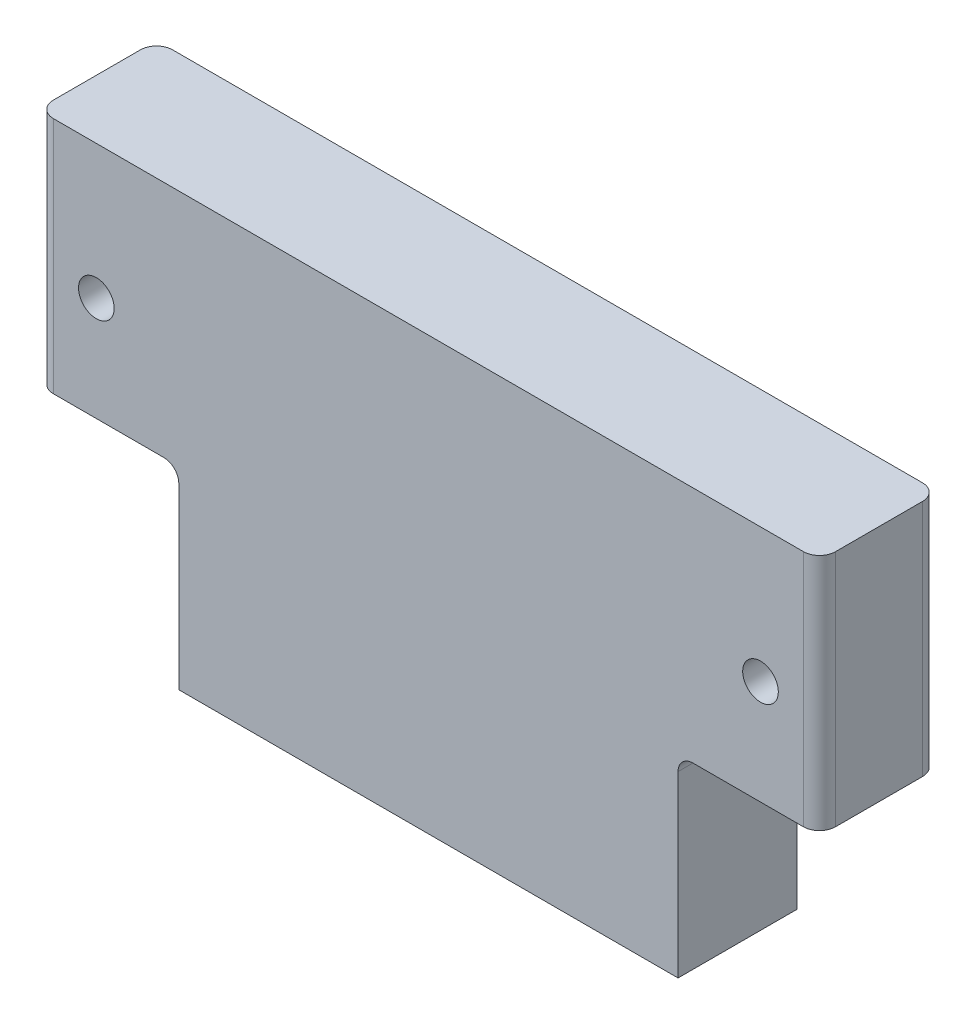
ISO-10303-21;
HEADER;
FILE_DESCRIPTION(('STEP AP214'),'2;1');
FILE_NAME('part.step','',(''),(''),'','','');
FILE_SCHEMA(('AUTOMOTIVE_DESIGN { 1 0 10303 214 1 1 1 1 }'));
ENDSEC;
DATA;
#1=APPLICATION_CONTEXT('core data for automotive mechanical design processes');
#2=APPLICATION_PROTOCOL_DEFINITION('international standard','automotive_design',2000,#1);
#3=PRODUCT_CONTEXT('',#1,'mechanical');
#4=PRODUCT('Part','Part','',(#3));
#5=PRODUCT_RELATED_PRODUCT_CATEGORY('part','',(#4));
#6=PRODUCT_DEFINITION_FORMATION('','',#4);
#7=PRODUCT_DEFINITION_CONTEXT('part definition',#1,'design');
#8=PRODUCT_DEFINITION('design','',#6,#7);
#9=PRODUCT_DEFINITION_SHAPE('','',#8);
#10=(LENGTH_UNIT() NAMED_UNIT(*) SI_UNIT(.MILLI.,.METRE.));
#11=(NAMED_UNIT(*) PLANE_ANGLE_UNIT() SI_UNIT($,.RADIAN.));
#12=(NAMED_UNIT(*) SI_UNIT($,.STERADIAN.) SOLID_ANGLE_UNIT());
#13=UNCERTAINTY_MEASURE_WITH_UNIT(LENGTH_MEASURE(1.E-05),#10,'distance_accuracy_value','');
#14=(GEOMETRIC_REPRESENTATION_CONTEXT(3) GLOBAL_UNCERTAINTY_ASSIGNED_CONTEXT((#13)) GLOBAL_UNIT_ASSIGNED_CONTEXT((#10,
#11,#12)) REPRESENTATION_CONTEXT('',''));
#15=CARTESIAN_POINT('',(0.,0.,0.));
#16=DIRECTION('',(0.,0.,1.));
#17=DIRECTION('',(1.,0.,0.));
#18=AXIS2_PLACEMENT_3D('',#15,#16,#17);
#19=CARTESIAN_POINT('',(-41.6814,-12.7,6.35));
#20=DIRECTION('',(0.,1.,0.));
#21=DIRECTION('',(0.,0.,1.));
#22=AXIS2_PLACEMENT_3D('',#19,#20,#21);
#23=PLANE('',#22);
#24=DIRECTION('',(1.,0.,0.));
#25=VECTOR('',#24,1.);
#26=CARTESIAN_POINT('',(-41.6814,-12.7,6.35));
#27=LINE('',#26,#25);
#28=CARTESIAN_POINT('',(28.1940000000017,-12.7,6.35));
#29=VERTEX_POINT('',#28);
#30=CARTESIAN_POINT('',(39.9669,-12.7,6.35));
#31=VERTEX_POINT('',#30);
#32=EDGE_CURVE('E183',#29,#31,#27,.T.);
#33=ORIENTED_EDGE('',*,*,#32,.F.);
#34=DIRECTION('',(0.,0.,1.));
#35=VECTOR('',#34,1.);
#36=CARTESIAN_POINT('',(28.1940000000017,-12.7,6.35));
#37=LINE('',#36,#35);
#38=CARTESIAN_POINT('',(28.1940000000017,-12.7,-6.35));
#39=VERTEX_POINT('',#38);
#40=EDGE_CURVE('E58',#29,#39,#37,.F.);
#41=ORIENTED_EDGE('',*,*,#40,.T.);
#42=DIRECTION('',(1.,0.,0.));
#43=VECTOR('',#42,1.);
#44=CARTESIAN_POINT('',(-41.6814,-12.7,-6.35));
#45=LINE('',#44,#43);
#46=CARTESIAN_POINT('',(39.9669,-12.7,-6.35));
#47=VERTEX_POINT('',#46);
#48=EDGE_CURVE('E190',#39,#47,#45,.T.);
#49=ORIENTED_EDGE('',*,*,#48,.T.);
#50=CARTESIAN_POINT('',(39.9669,-12.7,-4.6355));
#51=DIRECTION('',(0.,1.,0.));
#52=DIRECTION('',(0.,0.,1.));
#53=AXIS2_PLACEMENT_3D('',#50,#51,#52);
#54=CIRCLE('',#53,1.7145);
#55=CARTESIAN_POINT('',(41.6814,-12.7,-4.6355));
#56=VERTEX_POINT('',#55);
#57=EDGE_CURVE('E240',#47,#56,#54,.F.);
#58=ORIENTED_EDGE('',*,*,#57,.T.);
#59=DIRECTION('',(0.,0.,-1.));
#60=VECTOR('',#59,1.);
#61=CARTESIAN_POINT('',(41.6814,-12.7,6.35));
#62=LINE('',#61,#60);
#63=CARTESIAN_POINT('',(41.6814,-12.7,4.6355));
#64=VERTEX_POINT('',#63);
#65=EDGE_CURVE('E187',#64,#56,#62,.T.);
#66=ORIENTED_EDGE('',*,*,#65,.F.);
#67=CARTESIAN_POINT('',(39.9669,-12.7,4.6355));
#68=DIRECTION('',(0.,1.,0.));
#69=DIRECTION('',(0.,0.,1.));
#70=AXIS2_PLACEMENT_3D('',#67,#68,#69);
#71=CIRCLE('',#70,1.7145);
#72=EDGE_CURVE('E237',#64,#31,#71,.F.);
#73=ORIENTED_EDGE('',*,*,#72,.T.);
#74=EDGE_LOOP('',(#33,#41,#49,#58,#66,#73));
#75=FACE_BOUND('',#74,.T.);
#76=ADVANCED_FACE('F37',(#75),#23,.F.);
#77=CARTESIAN_POINT('',(41.6814,12.7,6.35));
#78=DIRECTION('',(-1.,0.,0.));
#79=DIRECTION('',(0.,0.,1.));
#80=AXIS2_PLACEMENT_3D('',#77,#78,#79);
#81=PLANE('',#80);
#82=ORIENTED_EDGE('',*,*,#65,.T.);
#83=DIRECTION('',(0.,1.,0.));
#84=VECTOR('',#83,1.);
#85=CARTESIAN_POINT('',(41.6814,12.7,-4.6355));
#86=LINE('',#85,#84);
#87=CARTESIAN_POINT('',(41.6814,12.7,-4.6355));
#88=VERTEX_POINT('',#87);
#89=EDGE_CURVE('E234',#56,#88,#86,.T.);
#90=ORIENTED_EDGE('',*,*,#89,.T.);
#91=DIRECTION('',(0.,0.,-1.));
#92=VECTOR('',#91,1.);
#93=CARTESIAN_POINT('',(41.6814,12.7,6.35));
#94=LINE('',#93,#92);
#95=CARTESIAN_POINT('',(41.6814,12.7,4.6355));
#96=VERTEX_POINT('',#95);
#97=EDGE_CURVE('E201',#96,#88,#94,.T.);
#98=ORIENTED_EDGE('',*,*,#97,.F.);
#99=DIRECTION('',(0.,1.,0.));
#100=VECTOR('',#99,1.);
#101=CARTESIAN_POINT('',(41.6814,-12.7,4.6355));
#102=LINE('',#101,#100);
#103=EDGE_CURVE('E232',#96,#64,#102,.F.);
#104=ORIENTED_EDGE('',*,*,#103,.T.);
#105=EDGE_LOOP('',(#82,#90,#98,#104));
#106=FACE_BOUND('',#105,.T.);
#107=ADVANCED_FACE('F275',(#106),#81,.F.);
#108=CARTESIAN_POINT('',(-41.6814,12.7,6.35));
#109=DIRECTION('',(0.,-1.,0.));
#110=DIRECTION('',(0.,0.,-1.));
#111=AXIS2_PLACEMENT_3D('',#108,#109,#110);
#112=PLANE('',#111);
#113=DIRECTION('',(-1.,0.,0.));
#114=VECTOR('',#113,1.);
#115=CARTESIAN_POINT('',(-41.6814,12.7,-6.35));
#116=LINE('',#115,#114);
#117=CARTESIAN_POINT('',(39.9669,12.7,-6.35));
#118=VERTEX_POINT('',#117);
#119=CARTESIAN_POINT('',(-39.9669,12.7,-6.35));
#120=VERTEX_POINT('',#119);
#121=EDGE_CURVE('E180',#118,#120,#116,.T.);
#122=ORIENTED_EDGE('',*,*,#121,.T.);
#123=CARTESIAN_POINT('',(-39.9669,12.7,-4.6355));
#124=DIRECTION('',(0.,-1.,0.));
#125=DIRECTION('',(0.,0.,-1.));
#126=AXIS2_PLACEMENT_3D('',#123,#124,#125);
#127=CIRCLE('',#126,1.7145);
#128=CARTESIAN_POINT('',(-41.6814,12.7,-4.6355));
#129=VERTEX_POINT('',#128);
#130=EDGE_CURVE('E224',#120,#129,#127,.F.);
#131=ORIENTED_EDGE('',*,*,#130,.T.);
#132=DIRECTION('',(0.,0.,-1.));
#133=VECTOR('',#132,1.);
#134=CARTESIAN_POINT('',(-41.6814,12.7,6.35));
#135=LINE('',#134,#133);
#136=CARTESIAN_POINT('',(-41.6814,12.7,4.6355));
#137=VERTEX_POINT('',#136);
#138=EDGE_CURVE('E198',#137,#129,#135,.T.);
#139=ORIENTED_EDGE('',*,*,#138,.F.);
#140=CARTESIAN_POINT('',(-39.9669,12.7,4.6355));
#141=DIRECTION('',(0.,-1.,0.));
#142=DIRECTION('',(0.,0.,-1.));
#143=AXIS2_PLACEMENT_3D('',#140,#141,#142);
#144=CIRCLE('',#143,1.7145);
#145=CARTESIAN_POINT('',(-39.9669,12.7,6.35));
#146=VERTEX_POINT('',#145);
#147=EDGE_CURVE('E222',#137,#146,#144,.F.);
#148=ORIENTED_EDGE('',*,*,#147,.T.);
#149=DIRECTION('',(-1.,0.,0.));
#150=VECTOR('',#149,1.);
#151=CARTESIAN_POINT('',(-41.6814,12.7,6.35));
#152=LINE('',#151,#150);
#153=CARTESIAN_POINT('',(39.9669,12.7,6.35));
#154=VERTEX_POINT('',#153);
#155=EDGE_CURVE('E181',#154,#146,#152,.T.);
#156=ORIENTED_EDGE('',*,*,#155,.F.);
#157=CARTESIAN_POINT('',(39.9669,12.7,4.6355));
#158=DIRECTION('',(0.,-1.,0.));
#159=DIRECTION('',(0.,0.,-1.));
#160=AXIS2_PLACEMENT_3D('',#157,#158,#159);
#161=CIRCLE('',#160,1.7145);
#162=EDGE_CURVE('E218',#154,#96,#161,.F.);
#163=ORIENTED_EDGE('',*,*,#162,.T.);
#164=ORIENTED_EDGE('',*,*,#97,.T.);
#165=CARTESIAN_POINT('',(39.9669,12.7,-4.6355));
#166=DIRECTION('',(0.,-1.,0.));
#167=DIRECTION('',(0.,0.,-1.));
#168=AXIS2_PLACEMENT_3D('',#165,#166,#167);
#169=CIRCLE('',#168,1.7145);
#170=EDGE_CURVE('E220',#88,#118,#169,.F.);
#171=ORIENTED_EDGE('',*,*,#170,.T.);
#172=EDGE_LOOP('',(#122,#131,#139,#148,#156,#163,#164,#171));
#173=FACE_BOUND('',#172,.T.);
#174=ADVANCED_FACE('F280',(#173),#112,.F.);
#175=CARTESIAN_POINT('',(-41.6814,12.7,6.35));
#176=DIRECTION('',(1.,0.,0.));
#177=DIRECTION('',(0.,0.,-1.));
#178=AXIS2_PLACEMENT_3D('',#175,#176,#177);
#179=PLANE('',#178);
#180=ORIENTED_EDGE('',*,*,#138,.T.);
#181=DIRECTION('',(0.,-1.,0.));
#182=VECTOR('',#181,1.);
#183=CARTESIAN_POINT('',(-41.6814,12.7,-4.6355));
#184=LINE('',#183,#182);
#185=CARTESIAN_POINT('',(-41.6814,-12.7,-4.6355));
#186=VERTEX_POINT('',#185);
#187=EDGE_CURVE('E206',#129,#186,#184,.T.);
#188=ORIENTED_EDGE('',*,*,#187,.T.);
#189=DIRECTION('',(0.,0.,-1.));
#190=VECTOR('',#189,1.);
#191=CARTESIAN_POINT('',(-41.6814,-12.7,6.35));
#192=LINE('',#191,#190);
#193=CARTESIAN_POINT('',(-41.6814,-12.7,4.6355));
#194=VERTEX_POINT('',#193);
#195=EDGE_CURVE('E195',#194,#186,#192,.T.);
#196=ORIENTED_EDGE('',*,*,#195,.F.);
#197=DIRECTION('',(0.,-1.,0.));
#198=VECTOR('',#197,1.);
#199=CARTESIAN_POINT('',(-41.6814,12.7,4.6355));
#200=LINE('',#199,#198);
#201=EDGE_CURVE('E204',#194,#137,#200,.F.);
#202=ORIENTED_EDGE('',*,*,#201,.T.);
#203=EDGE_LOOP('',(#180,#188,#196,#202));
#204=FACE_BOUND('',#203,.T.);
#205=ADVANCED_FACE('F286',(#204),#179,.F.);
#206=CARTESIAN_POINT('',(-39.9669,-12.7,-6.35));
#207=VERTEX_POINT('',#206);
#208=CARTESIAN_POINT('',(-28.1940000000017,-12.7,-6.35));
#209=VERTEX_POINT('',#208);
#210=EDGE_CURVE('E184',#207,#209,#45,.T.);
#211=ORIENTED_EDGE('',*,*,#210,.T.);
#212=DIRECTION('',(0.,0.,1.));
#213=VECTOR('',#212,1.);
#214=CARTESIAN_POINT('',(-28.1940000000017,-12.7,6.35));
#215=LINE('',#214,#213);
#216=CARTESIAN_POINT('',(-28.1940000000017,-12.7,6.35));
#217=VERTEX_POINT('',#216);
#218=EDGE_CURVE('E242',#209,#217,#215,.T.);
#219=ORIENTED_EDGE('',*,*,#218,.T.);
#220=CARTESIAN_POINT('',(-39.9669,-12.7,6.35));
#221=VERTEX_POINT('',#220);
#222=EDGE_CURVE('E185',#221,#217,#27,.T.);
#223=ORIENTED_EDGE('',*,*,#222,.F.);
#224=CARTESIAN_POINT('',(-39.9669,-12.7,4.6355));
#225=DIRECTION('',(0.,1.,0.));
#226=DIRECTION('',(0.,0.,1.));
#227=AXIS2_PLACEMENT_3D('',#224,#225,#226);
#228=CIRCLE('',#227,1.7145);
#229=EDGE_CURVE('E209',#221,#194,#228,.F.);
#230=ORIENTED_EDGE('',*,*,#229,.T.);
#231=ORIENTED_EDGE('',*,*,#195,.T.);
#232=CARTESIAN_POINT('',(-39.9669,-12.7,-4.6355));
#233=DIRECTION('',(0.,1.,0.));
#234=DIRECTION('',(0.,0.,1.));
#235=AXIS2_PLACEMENT_3D('',#232,#233,#234);
#236=CIRCLE('',#235,1.7145);
#237=EDGE_CURVE('E211',#186,#207,#236,.F.);
#238=ORIENTED_EDGE('',*,*,#237,.T.);
#239=EDGE_LOOP('',(#211,#219,#223,#230,#231,#238));
#240=FACE_BOUND('',#239,.T.);
#241=ADVANCED_FACE('F261',(#240),#23,.F.);
#242=CARTESIAN_POINT('',(0.,0.,6.35));
#243=DIRECTION('',(0.,0.,1.));
#244=DIRECTION('',(1.,0.,0.));
#245=AXIS2_PLACEMENT_3D('',#242,#243,#244);
#246=PLANE('',#245);
#247=CARTESIAN_POINT('',(-35.3949,-1.58750000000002,6.35));
#248=DIRECTION('',(0.,0.,1.));
#249=DIRECTION('',(1.,0.,0.));
#250=AXIS2_PLACEMENT_3D('',#247,#248,#249);
#251=CIRCLE('',#250,1.89864999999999);
#252=CARTESIAN_POINT('',(-33.49625,-1.58750000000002,6.35));
#253=VERTEX_POINT('',#252);
#254=EDGE_CURVE('E168',#253,#253,#251,.T.);
#255=ORIENTED_EDGE('',*,*,#254,.F.);
#256=EDGE_LOOP('',(#255));
#257=FACE_BOUND('',#256,.T.);
#258=CARTESIAN_POINT('',(35.3949,-1.5874999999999,6.35));
#259=DIRECTION('',(0.,0.,1.));
#260=DIRECTION('',(1.,0.,0.));
#261=AXIS2_PLACEMENT_3D('',#258,#259,#260);
#262=CIRCLE('',#261,1.89864999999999);
#263=CARTESIAN_POINT('',(37.29355,-1.5874999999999,6.35));
#264=VERTEX_POINT('',#263);
#265=EDGE_CURVE('E174',#264,#264,#262,.T.);
#266=ORIENTED_EDGE('',*,*,#265,.F.);
#267=EDGE_LOOP('',(#266));
#268=FACE_BOUND('',#267,.T.);
#269=ORIENTED_EDGE('',*,*,#155,.T.);
#270=DIRECTION('',(0.,-1.,0.));
#271=VECTOR('',#270,1.);
#272=CARTESIAN_POINT('',(-39.9669,-12.7,6.35));
#273=LINE('',#272,#271);
#274=EDGE_CURVE('E229',#146,#221,#273,.T.);
#275=ORIENTED_EDGE('',*,*,#274,.T.);
#276=ORIENTED_EDGE('',*,*,#222,.T.);
#277=CARTESIAN_POINT('',(-28.1940000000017,-14.2875,6.35));
#278=DIRECTION('',(0.,0.,1.));
#279=DIRECTION('',(1.,0.,0.));
#280=AXIS2_PLACEMENT_3D('',#277,#278,#279);
#281=CIRCLE('',#280,1.5875);
#282=CARTESIAN_POINT('',(-26.6065000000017,-14.2875,6.35));
#283=VERTEX_POINT('',#282);
#284=EDGE_CURVE('E142',#217,#283,#281,.F.);
#285=ORIENTED_EDGE('',*,*,#284,.T.);
#286=DIRECTION('',(0.,-1.,0.));
#287=VECTOR('',#286,1.);
#288=CARTESIAN_POINT('',(-26.6065000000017,-12.7,6.35));
#289=LINE('',#288,#287);
#290=CARTESIAN_POINT('',(-26.6065000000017,-33.3375,6.35));
#291=VERTEX_POINT('',#290);
#292=EDGE_CURVE('E135',#283,#291,#289,.T.);
#293=ORIENTED_EDGE('',*,*,#292,.T.);
#294=DIRECTION('',(1.,0.,0.));
#295=VECTOR('',#294,1.);
#296=CARTESIAN_POINT('',(-26.6065000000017,-33.3375,6.35));
#297=LINE('',#296,#295);
#298=CARTESIAN_POINT('',(26.6065000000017,-33.3375,6.35));
#299=VERTEX_POINT('',#298);
#300=EDGE_CURVE('E140',#291,#299,#297,.T.);
#301=ORIENTED_EDGE('',*,*,#300,.T.);
#302=DIRECTION('',(0.,1.,0.));
#303=VECTOR('',#302,1.);
#304=CARTESIAN_POINT('',(26.6065000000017,-12.7,6.35));
#305=LINE('',#304,#303);
#306=CARTESIAN_POINT('',(26.6065000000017,-14.2875,6.35));
#307=VERTEX_POINT('',#306);
#308=EDGE_CURVE('E155',#299,#307,#305,.T.);
#309=ORIENTED_EDGE('',*,*,#308,.T.);
#310=CARTESIAN_POINT('',(28.1940000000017,-14.2875,6.34999999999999));
#311=DIRECTION('',(0.,0.,1.));
#312=DIRECTION('',(1.,0.,0.));
#313=AXIS2_PLACEMENT_3D('',#310,#311,#312);
#314=CIRCLE('',#313,1.5875);
#315=EDGE_CURVE('E45',#307,#29,#314,.F.);
#316=ORIENTED_EDGE('',*,*,#315,.T.);
#317=ORIENTED_EDGE('',*,*,#32,.T.);
#318=DIRECTION('',(0.,1.,0.));
#319=VECTOR('',#318,1.);
#320=CARTESIAN_POINT('',(39.9669,12.7,6.35));
#321=LINE('',#320,#319);
#322=EDGE_CURVE('E226',#31,#154,#321,.T.);
#323=ORIENTED_EDGE('',*,*,#322,.T.);
#324=EDGE_LOOP('',(#269,#275,#276,#285,#293,#301,#309,#316,#317,#323));
#325=FACE_BOUND('',#324,.T.);
#326=ADVANCED_FACE('F138',(#257,#268,#325),#246,.T.);
#327=CARTESIAN_POINT('',(0.,0.,-6.35));
#328=DIRECTION('',(0.,0.,1.));
#329=DIRECTION('',(1.,0.,0.));
#330=AXIS2_PLACEMENT_3D('',#327,#328,#329);
#331=PLANE('',#330);
#332=CARTESIAN_POINT('',(-35.3949,-1.58750000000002,-6.35));
#333=DIRECTION('',(0.,0.,1.));
#334=DIRECTION('',(1.,0.,0.));
#335=AXIS2_PLACEMENT_3D('',#332,#333,#334);
#336=CIRCLE('',#335,1.89864999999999);
#337=CARTESIAN_POINT('',(-33.49625,-1.58750000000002,-6.35));
#338=VERTEX_POINT('',#337);
#339=EDGE_CURVE('E171',#338,#338,#336,.T.);
#340=ORIENTED_EDGE('',*,*,#339,.T.);
#341=EDGE_LOOP('',(#340));
#342=FACE_BOUND('',#341,.T.);
#343=CARTESIAN_POINT('',(35.3949,-1.5874999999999,-6.35));
#344=DIRECTION('',(0.,0.,1.));
#345=DIRECTION('',(1.,0.,0.));
#346=AXIS2_PLACEMENT_3D('',#343,#344,#345);
#347=CIRCLE('',#346,1.89864999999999);
#348=CARTESIAN_POINT('',(37.29355,-1.5874999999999,-6.35));
#349=VERTEX_POINT('',#348);
#350=EDGE_CURVE('E177',#349,#349,#347,.T.);
#351=ORIENTED_EDGE('',*,*,#350,.T.);
#352=EDGE_LOOP('',(#351));
#353=FACE_BOUND('',#352,.T.);
#354=ORIENTED_EDGE('',*,*,#210,.F.);
#355=DIRECTION('',(0.,-1.,0.));
#356=VECTOR('',#355,1.);
#357=CARTESIAN_POINT('',(-39.9669,0.,-6.35));
#358=LINE('',#357,#356);
#359=EDGE_CURVE('E216',#207,#120,#358,.F.);
#360=ORIENTED_EDGE('',*,*,#359,.T.);
#361=ORIENTED_EDGE('',*,*,#121,.F.);
#362=DIRECTION('',(0.,1.,0.));
#363=VECTOR('',#362,1.);
#364=CARTESIAN_POINT('',(39.9669,0.,-6.35));
#365=LINE('',#364,#363);
#366=EDGE_CURVE('E213',#118,#47,#365,.F.);
#367=ORIENTED_EDGE('',*,*,#366,.T.);
#368=ORIENTED_EDGE('',*,*,#48,.F.);
#369=CARTESIAN_POINT('',(28.1940000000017,-14.2875,-6.35));
#370=DIRECTION('',(0.,0.,1.));
#371=DIRECTION('',(1.,0.,0.));
#372=AXIS2_PLACEMENT_3D('',#369,#370,#371);
#373=CIRCLE('',#372,1.5875);
#374=CARTESIAN_POINT('',(26.6065000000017,-14.2875,-6.35));
#375=VERTEX_POINT('',#374);
#376=EDGE_CURVE('E11',#39,#375,#373,.T.);
#377=ORIENTED_EDGE('',*,*,#376,.T.);
#378=DIRECTION('',(0.,-1.,0.));
#379=VECTOR('',#378,1.);
#380=CARTESIAN_POINT('',(26.6065000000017,-12.7,-6.35));
#381=LINE('',#380,#379);
#382=CARTESIAN_POINT('',(26.6065000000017,-33.3375,-6.35));
#383=VERTEX_POINT('',#382);
#384=EDGE_CURVE('E164',#375,#383,#381,.T.);
#385=ORIENTED_EDGE('',*,*,#384,.T.);
#386=DIRECTION('',(-1.,0.,0.));
#387=VECTOR('',#386,1.);
#388=CARTESIAN_POINT('',(-26.6065000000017,-33.3375,-6.35));
#389=LINE('',#388,#387);
#390=CARTESIAN_POINT('',(-26.6065000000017,-33.3375,-6.35));
#391=VERTEX_POINT('',#390);
#392=EDGE_CURVE('E166',#383,#391,#389,.T.);
#393=ORIENTED_EDGE('',*,*,#392,.T.);
#394=DIRECTION('',(0.,1.,0.));
#395=VECTOR('',#394,1.);
#396=CARTESIAN_POINT('',(-26.6065000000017,-12.7,-6.35));
#397=LINE('',#396,#395);
#398=CARTESIAN_POINT('',(-26.6065000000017,-14.2875,-6.35));
#399=VERTEX_POINT('',#398);
#400=EDGE_CURVE('E151',#391,#399,#397,.T.);
#401=ORIENTED_EDGE('',*,*,#400,.T.);
#402=CARTESIAN_POINT('',(-28.1940000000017,-14.2875,-6.35));
#403=DIRECTION('',(0.,0.,1.));
#404=DIRECTION('',(1.,0.,0.));
#405=AXIS2_PLACEMENT_3D('',#402,#403,#404);
#406=CIRCLE('',#405,1.5875);
#407=EDGE_CURVE('E252',#399,#209,#406,.T.);
#408=ORIENTED_EDGE('',*,*,#407,.T.);
#409=EDGE_LOOP('',(#354,#360,#361,#367,#368,#377,#385,#393,#401,#408));
#410=FACE_BOUND('',#409,.T.);
#411=ADVANCED_FACE('F256',(#342,#353,#410),#331,.F.);
#412=CARTESIAN_POINT('',(35.3949,-1.5874999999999,6.35));
#413=DIRECTION('',(0.,0.,1.));
#414=DIRECTION('',(1.,0.,0.));
#415=AXIS2_PLACEMENT_3D('',#412,#413,#414);
#416=CYLINDRICAL_SURFACE('',#415,1.89864999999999);
#417=ORIENTED_EDGE('',*,*,#350,.F.);
#418=EDGE_LOOP('',(#417));
#419=FACE_BOUND('',#418,.T.);
#420=ORIENTED_EDGE('',*,*,#265,.T.);
#421=EDGE_LOOP('',(#420));
#422=FACE_BOUND('',#421,.T.);
#423=ADVANCED_FACE('F338',(#419,#422),#416,.F.);
#424=CARTESIAN_POINT('',(-35.3949,-1.58750000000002,6.35));
#425=DIRECTION('',(0.,0.,1.));
#426=DIRECTION('',(1.,0.,0.));
#427=AXIS2_PLACEMENT_3D('',#424,#425,#426);
#428=CYLINDRICAL_SURFACE('',#427,1.89864999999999);
#429=ORIENTED_EDGE('',*,*,#339,.F.);
#430=EDGE_LOOP('',(#429));
#431=FACE_BOUND('',#430,.T.);
#432=ORIENTED_EDGE('',*,*,#254,.T.);
#433=EDGE_LOOP('',(#432));
#434=FACE_BOUND('',#433,.T.);
#435=ADVANCED_FACE('F333',(#431,#434),#428,.F.);
#436=CARTESIAN_POINT('',(-26.6065000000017,-12.7,-63.424773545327));
#437=DIRECTION('',(-1.,0.,0.));
#438=DIRECTION('',(0.,-1.,0.));
#439=AXIS2_PLACEMENT_3D('',#436,#437,#438);
#440=PLANE('',#439);
#441=ORIENTED_EDGE('',*,*,#292,.F.);
#442=DIRECTION('',(0.,0.,1.));
#443=VECTOR('',#442,1.);
#444=CARTESIAN_POINT('',(-26.6065000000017,-14.2875,-63.424773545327));
#445=LINE('',#444,#443);
#446=EDGE_CURVE('E245',#283,#399,#445,.F.);
#447=ORIENTED_EDGE('',*,*,#446,.T.);
#448=ORIENTED_EDGE('',*,*,#400,.F.);
#449=DIRECTION('',(0.,0.,1.));
#450=VECTOR('',#449,1.);
#451=CARTESIAN_POINT('',(-26.6065000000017,-33.3375,-63.424773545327));
#452=LINE('',#451,#450);
#453=EDGE_CURVE('E148',#391,#291,#452,.T.);
#454=ORIENTED_EDGE('',*,*,#453,.T.);
#455=EDGE_LOOP('',(#441,#447,#448,#454));
#456=FACE_BOUND('',#455,.T.);
#457=ADVANCED_FACE('F149',(#456),#440,.T.);
#458=CARTESIAN_POINT('',(26.6065000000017,-12.7,-63.424773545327));
#459=DIRECTION('',(1.,0.,0.));
#460=DIRECTION('',(0.,1.,0.));
#461=AXIS2_PLACEMENT_3D('',#458,#459,#460);
#462=PLANE('',#461);
#463=ORIENTED_EDGE('',*,*,#384,.F.);
#464=DIRECTION('',(0.,0.,1.));
#465=VECTOR('',#464,1.);
#466=CARTESIAN_POINT('',(26.6065000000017,-14.2875,-63.424773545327));
#467=LINE('',#466,#465);
#468=EDGE_CURVE('E247',#375,#307,#467,.T.);
#469=ORIENTED_EDGE('',*,*,#468,.T.);
#470=ORIENTED_EDGE('',*,*,#308,.F.);
#471=DIRECTION('',(0.,0.,1.));
#472=VECTOR('',#471,1.);
#473=CARTESIAN_POINT('',(26.6065000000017,-33.3375,-63.424773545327));
#474=LINE('',#473,#472);
#475=EDGE_CURVE('E154',#383,#299,#474,.T.);
#476=ORIENTED_EDGE('',*,*,#475,.F.);
#477=EDGE_LOOP('',(#463,#469,#470,#476));
#478=FACE_BOUND('',#477,.T.);
#479=ADVANCED_FACE('F324',(#478),#462,.T.);
#480=CARTESIAN_POINT('',(-26.6065000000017,-33.3375,-63.424773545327));
#481=DIRECTION('',(0.,-1.,0.));
#482=DIRECTION('',(0.,0.,-1.));
#483=AXIS2_PLACEMENT_3D('',#480,#481,#482);
#484=PLANE('',#483);
#485=ORIENTED_EDGE('',*,*,#392,.F.);
#486=ORIENTED_EDGE('',*,*,#475,.T.);
#487=ORIENTED_EDGE('',*,*,#300,.F.);
#488=ORIENTED_EDGE('',*,*,#453,.F.);
#489=EDGE_LOOP('',(#485,#486,#487,#488));
#490=FACE_BOUND('',#489,.T.);
#491=ADVANCED_FACE('F157',(#490),#484,.T.);
#492=CARTESIAN_POINT('',(-39.9669,12.7,-4.6355));
#493=DIRECTION('',(0.,-1.,0.));
#494=DIRECTION('',(0.,0.,-1.));
#495=AXIS2_PLACEMENT_3D('',#492,#493,#494);
#496=CYLINDRICAL_SURFACE('',#495,1.7145);
#497=ORIENTED_EDGE('',*,*,#130,.F.);
#498=ORIENTED_EDGE('',*,*,#359,.F.);
#499=ORIENTED_EDGE('',*,*,#237,.F.);
#500=ORIENTED_EDGE('',*,*,#187,.F.);
#501=EDGE_LOOP('',(#497,#498,#499,#500));
#502=FACE_BOUND('',#501,.T.);
#503=ADVANCED_FACE('F300',(#502),#496,.T.);
#504=CARTESIAN_POINT('',(-39.9669,0.,4.6355));
#505=DIRECTION('',(0.,1.,0.));
#506=DIRECTION('',(0.,0.,1.));
#507=AXIS2_PLACEMENT_3D('',#504,#505,#506);
#508=CYLINDRICAL_SURFACE('',#507,1.7145);
#509=ORIENTED_EDGE('',*,*,#147,.F.);
#510=ORIENTED_EDGE('',*,*,#201,.F.);
#511=ORIENTED_EDGE('',*,*,#229,.F.);
#512=ORIENTED_EDGE('',*,*,#274,.F.);
#513=EDGE_LOOP('',(#509,#510,#511,#512));
#514=FACE_BOUND('',#513,.T.);
#515=ADVANCED_FACE('F303',(#514),#508,.T.);
#516=CARTESIAN_POINT('',(39.9669,12.7,-4.6355));
#517=DIRECTION('',(0.,1.,0.));
#518=DIRECTION('',(0.,0.,1.));
#519=AXIS2_PLACEMENT_3D('',#516,#517,#518);
#520=CYLINDRICAL_SURFACE('',#519,1.7145);
#521=ORIENTED_EDGE('',*,*,#57,.F.);
#522=ORIENTED_EDGE('',*,*,#366,.F.);
#523=ORIENTED_EDGE('',*,*,#170,.F.);
#524=ORIENTED_EDGE('',*,*,#89,.F.);
#525=EDGE_LOOP('',(#521,#522,#523,#524));
#526=FACE_BOUND('',#525,.T.);
#527=ADVANCED_FACE('F271',(#526),#520,.T.);
#528=CARTESIAN_POINT('',(39.9669,0.,4.6355));
#529=DIRECTION('',(0.,-1.,0.));
#530=DIRECTION('',(0.,0.,-1.));
#531=AXIS2_PLACEMENT_3D('',#528,#529,#530);
#532=CYLINDRICAL_SURFACE('',#531,1.7145);
#533=ORIENTED_EDGE('',*,*,#72,.F.);
#534=ORIENTED_EDGE('',*,*,#103,.F.);
#535=ORIENTED_EDGE('',*,*,#162,.F.);
#536=ORIENTED_EDGE('',*,*,#322,.F.);
#537=EDGE_LOOP('',(#533,#534,#535,#536));
#538=FACE_BOUND('',#537,.T.);
#539=ADVANCED_FACE('F265',(#538),#532,.T.);
#540=CARTESIAN_POINT('',(-28.1940000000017,-14.2875,6.35));
#541=DIRECTION('',(0.,0.,1.));
#542=DIRECTION('',(1.,0.,0.));
#543=AXIS2_PLACEMENT_3D('',#540,#541,#542);
#544=CYLINDRICAL_SURFACE('',#543,1.5875);
#545=ORIENTED_EDGE('',*,*,#407,.F.);
#546=ORIENTED_EDGE('',*,*,#446,.F.);
#547=ORIENTED_EDGE('',*,*,#284,.F.);
#548=ORIENTED_EDGE('',*,*,#218,.F.);
#549=EDGE_LOOP('',(#545,#546,#547,#548));
#550=FACE_BOUND('',#549,.T.);
#551=ADVANCED_FACE('F263',(#550),#544,.F.);
#552=CARTESIAN_POINT('',(28.1940000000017,-14.2875,-63.424773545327));
#553=DIRECTION('',(0.,0.,1.));
#554=DIRECTION('',(1.,0.,0.));
#555=AXIS2_PLACEMENT_3D('',#552,#553,#554);
#556=CYLINDRICAL_SURFACE('',#555,1.5875);
#557=ORIENTED_EDGE('',*,*,#376,.F.);
#558=ORIENTED_EDGE('',*,*,#40,.F.);
#559=ORIENTED_EDGE('',*,*,#315,.F.);
#560=ORIENTED_EDGE('',*,*,#468,.F.);
#561=EDGE_LOOP('',(#557,#558,#559,#560));
#562=FACE_BOUND('',#561,.T.);
#563=ADVANCED_FACE('F39',(#562),#556,.F.);
#564=CLOSED_SHELL('',(#76,#107,#174,#205,#241,#326,#411,#423,#435,#457,#479,#491,#503,#515,#527,
#539,#551,#563));
#565=MANIFOLD_SOLID_BREP('B2',#564);
#566=ADVANCED_BREP_SHAPE_REPRESENTATION('',(#18,#565),#14);
#567=SHAPE_DEFINITION_REPRESENTATION(#9,#566);
ENDSEC;
END-ISO-10303-21;
